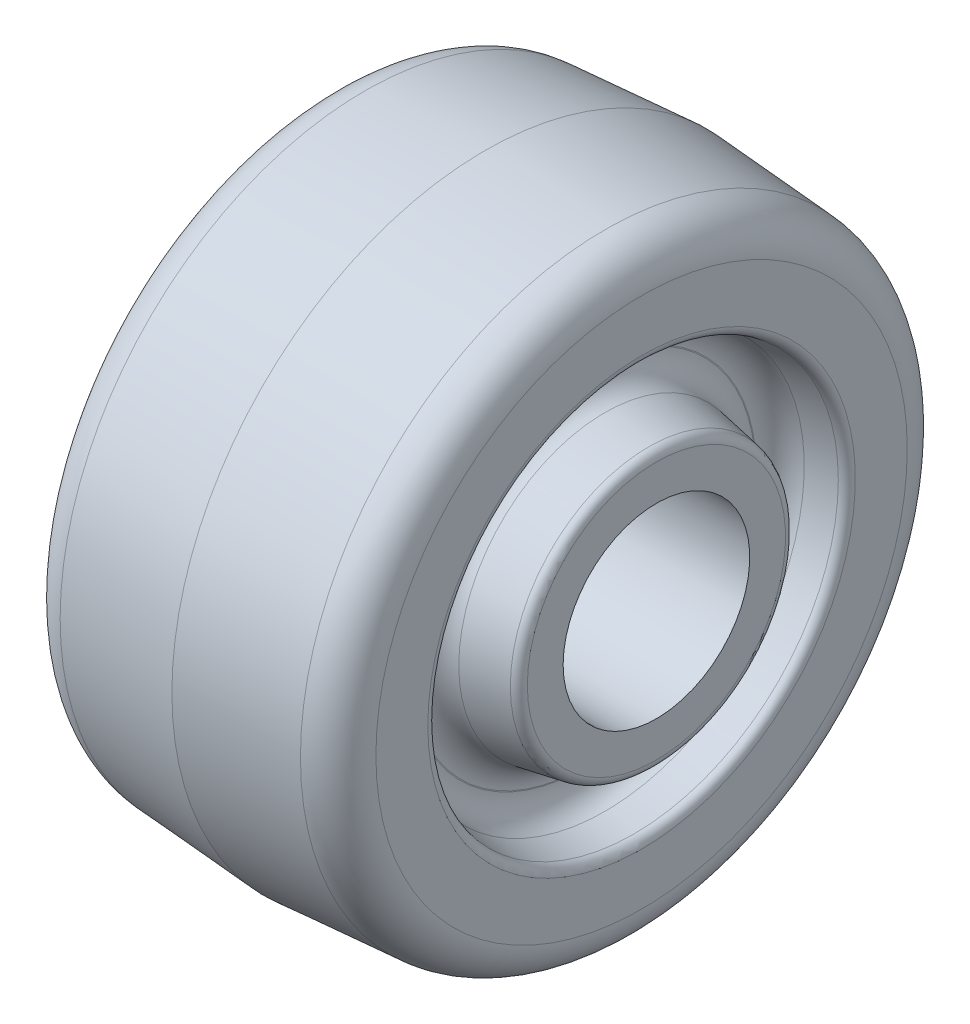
from build123d import *


with BuildPart() as part:
    # Sketch1 → Revolve1 (revolve)
    with BuildSketch(Plane.XY, mode=Mode.PRIVATE) as revolve1_sk:
        with BuildLine():
            Line((0, 50.8), (19.492953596, 49.436919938))
            ThreePointArc((19.492953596, 49.436919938), (23.694096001, 47.433077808), (25.4, 43.102388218))
            Line((25.4, 43.102388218), (25.4, 34.67978783))
            ThreePointArc((25.4, 34.67978783), (25.043451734, 33.700179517), (24.140639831, 33.178940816))
            Line((24.140639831, 33.178940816), (19.443187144, 32.350653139))
            ThreePointArc((19.443187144, 32.350653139), (16.885220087, 30.873810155), (15.875, 28.098253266))
            Line((15.875, 28.098253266), (15.875, 27.953223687))
            ThreePointArc((15.875, 27.953223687), (16.885220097, 25.177666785), (19.443187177, 23.700823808))
            Line((19.443187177, 23.700823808), (26.55363982, 22.447059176))
            ThreePointArc((26.55363982, 22.447059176), (27.45645173, 21.925820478), (27.813, 20.94621216))
            Line((27.813, 20.94621216), (27.813, 15.1384))
            Line((27.813, 15.1384), (-27.813, 15.1384))
            Line((-27.813, 15.1384), (-27.813, 20.94621216))
            ThreePointArc((-27.813, 20.94621216), (-27.45645173, 21.925820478), (-26.55363982, 22.447059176))
            Line((-26.55363982, 22.447059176), (-19.443187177, 23.700823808))
            ThreePointArc((-19.443187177, 23.700823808), (-16.885220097, 25.177666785), (-15.875, 27.953223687))
            Line((-15.875, 27.953223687), (-15.875, 28.098253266))
            ThreePointArc((-15.875, 28.098253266), (-16.885220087, 30.873810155), (-19.443187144, 32.350653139))
            Line((-19.443187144, 32.350653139), (-24.140639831, 33.178940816))
            ThreePointArc((-24.140639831, 33.178940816), (-25.043451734, 33.700179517), (-25.4, 34.67978783))
            Line((-25.4, 34.67978783), (-25.4, 43.102388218))
            ThreePointArc((-25.4, 43.102388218), (-23.694096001, 47.433077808), (-19.492953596, 49.436919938))
            Line((-19.492953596, 49.436919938), (0, 50.8))
        make_face()
    revolve(revolve1_sk.sketch.rotate(Axis((-38.862204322, 0, 0), (1, 0, 0)), 90), axis=Axis((-38.862204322, 0, 0), (1, 0, 0)))


solid = part.part
